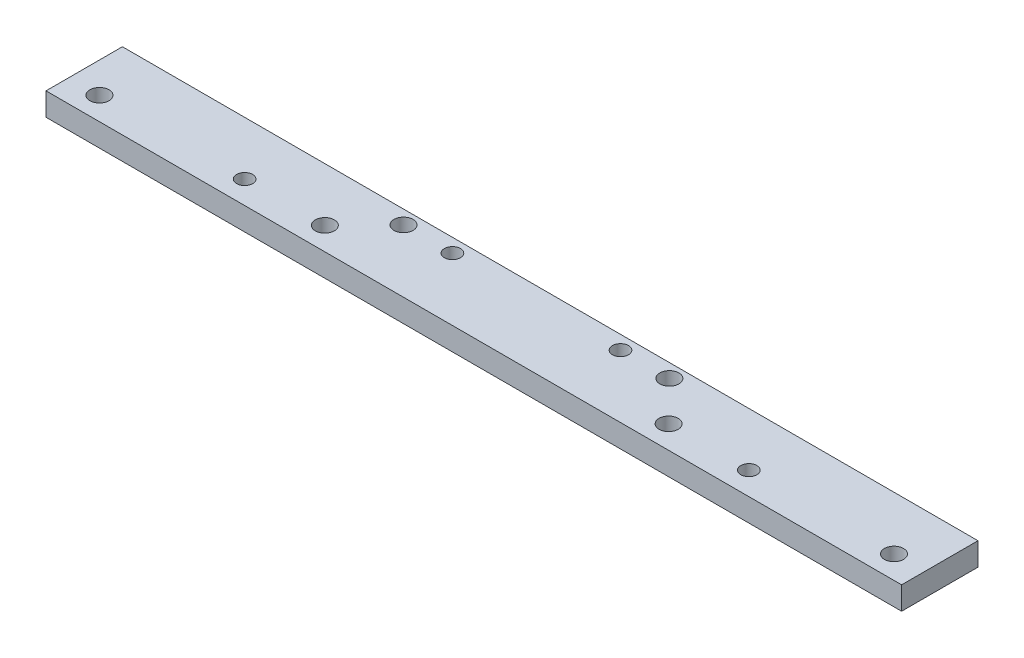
from build123d import *

# Parameters (mm, degrees)
ESQUISSE1_W             = 50
ESQUISSE1_H             = 15
EXTRUSION1_DEPTH        = 280
ENL_V_MAT_EXTRU_1_REACH = 283.514
ESQUISSE3_R             = 5.25
ESQUISSE3_R_2           = 6.25


with BuildPart() as part:
    # Esquisse1 → Extrusion1 (new, symmetric)
    with BuildSketch(Plane(origin=(0, 0, 0), x_dir=(0, 0, -1), z_dir=(1, 0, 0))):
        with Locations((0, 7.5)):
            Rectangle(ESQUISSE1_W, ESQUISSE1_H)
    extrude(amount=EXTRUSION1_DEPTH, both=True)

    # Esquisse3 → Enl_v. mat.-Extru.1 (cut, up to next)
    with BuildSketch(Plane(origin=(0, 15, 0), x_dir=(-1, 0, 0), z_dir=(0, 1, 0)), mode=Mode.PRIVATE) as enl_v_mat_extru_1_sk1:
        with Locations(Location((-55, -16, 0), (0, 0, 90))):
            Circle(ESQUISSE3_R)
    enl_v_mat_extru_1_tool1 = extrude(enl_v_mat_extru_1_sk1.sketch, amount=-ENL_V_MAT_EXTRU_1_REACH, mode=Mode.PRIVATE) & part.part
    # Esquisse3 → Enl_v. mat.-Extru.1 (cut, up to next)
    with BuildSketch(Plane(origin=(0, 15, 0), x_dir=(-1, 0, 0), z_dir=(0, 1, 0)), mode=Mode.PRIVATE) as enl_v_mat_extru_1_sk2:
        with Locations(Location((55, -16, 0), (0, 0, 90))):
            Circle(ESQUISSE3_R)
    enl_v_mat_extru_1_tool2 = extrude(enl_v_mat_extru_1_sk2.sketch, amount=-ENL_V_MAT_EXTRU_1_REACH, mode=Mode.PRIVATE) & part.part
    # Esquisse3 → Enl_v. mat.-Extru.1 (cut, up to next)
    with BuildSketch(Plane(origin=(0, 15, 0), x_dir=(-1, 0, 0), z_dir=(0, 1, 0)), mode=Mode.PRIVATE) as enl_v_mat_extru_1_sk3:
        with Locations(Location((-87, -16, 0), (0, 0, 90))):
            Circle(ESQUISSE3_R_2)
    enl_v_mat_extru_1_tool3 = extrude(enl_v_mat_extru_1_sk3.sketch, amount=-ENL_V_MAT_EXTRU_1_REACH, mode=Mode.PRIVATE) & part.part
    # Esquisse3 → Enl_v. mat.-Extru.1 (cut, up to next)
    with BuildSketch(Plane(origin=(0, 15, 0), x_dir=(-1, 0, 0), z_dir=(0, 1, 0)), mode=Mode.PRIVATE) as enl_v_mat_extru_1_sk4:
        with Locations(Location((87, -16, 0), (0, 0, 90))):
            Circle(ESQUISSE3_R_2)
    enl_v_mat_extru_1_tool4 = extrude(enl_v_mat_extru_1_sk4.sketch, amount=-ENL_V_MAT_EXTRU_1_REACH, mode=Mode.PRIVATE) & part.part
    # Esquisse3 → Enl_v. mat.-Extru.1 (cut, up to next)
    with BuildSketch(Plane(origin=(0, 15, 0), x_dir=(-1, 0, 0), z_dir=(0, 1, 0)), mode=Mode.PRIVATE) as enl_v_mat_extru_1_sk5:
        with Locations(Location((-112.5, 10, 0), (0, 0, 90))):
            Circle(ESQUISSE3_R_2)
    enl_v_mat_extru_1_tool5 = extrude(enl_v_mat_extru_1_sk5.sketch, amount=-ENL_V_MAT_EXTRU_1_REACH, mode=Mode.PRIVATE) & part.part
    # Esquisse3 → Enl_v. mat.-Extru.1 (cut, up to next)
    with BuildSketch(Plane(origin=(0, 15, 0), x_dir=(-1, 0, 0), z_dir=(0, 1, 0)), mode=Mode.PRIVATE) as enl_v_mat_extru_1_sk6:
        with Locations(Location((112.5, 10, 0), (0, 0, 90))):
            Circle(ESQUISSE3_R_2)
    enl_v_mat_extru_1_tool6 = extrude(enl_v_mat_extru_1_sk6.sketch, amount=-ENL_V_MAT_EXTRU_1_REACH, mode=Mode.PRIVATE) & part.part
    # Esquisse3 → Enl_v. mat.-Extru.1 (cut, up to next)
    with BuildSketch(Plane(origin=(0, 15, 0), x_dir=(-1, 0, 0), z_dir=(0, 1, 0)), mode=Mode.PRIVATE) as enl_v_mat_extru_1_sk7:
        with Locations(Location((-165, 10, 0), (0, 0, 90))):
            Circle(ESQUISSE3_R)
    enl_v_mat_extru_1_tool7 = extrude(enl_v_mat_extru_1_sk7.sketch, amount=-ENL_V_MAT_EXTRU_1_REACH, mode=Mode.PRIVATE) & part.part
    # Esquisse3 → Enl_v. mat.-Extru.1 (cut, up to next)
    with BuildSketch(Plane(origin=(0, 15, 0), x_dir=(-1, 0, 0), z_dir=(0, 1, 0)), mode=Mode.PRIVATE) as enl_v_mat_extru_1_sk8:
        with Locations(Location((165, 10, 0), (0, 0, 90))):
            Circle(ESQUISSE3_R)
    enl_v_mat_extru_1_tool8 = extrude(enl_v_mat_extru_1_sk8.sketch, amount=-ENL_V_MAT_EXTRU_1_REACH, mode=Mode.PRIVATE) & part.part
    # Esquisse3 → Enl_v. mat.-Extru.1 (cut, up to next)
    with BuildSketch(Plane(origin=(0, 15, 0), x_dir=(-1, 0, 0), z_dir=(0, 1, 0)), mode=Mode.PRIVATE) as enl_v_mat_extru_1_sk9:
        with Locations(Location((-260, 10, 0), (0, 0, 90))):
            Circle(ESQUISSE3_R_2)
    enl_v_mat_extru_1_tool9 = extrude(enl_v_mat_extru_1_sk9.sketch, amount=-ENL_V_MAT_EXTRU_1_REACH, mode=Mode.PRIVATE) & part.part
    # Esquisse3 → Enl_v. mat.-Extru.1 (cut, up to next)
    with BuildSketch(Plane(origin=(0, 15, 0), x_dir=(-1, 0, 0), z_dir=(0, 1, 0)), mode=Mode.PRIVATE) as enl_v_mat_extru_1_sk10:
        with Locations(Location((260, 10, 0), (0, 0, 90))):
            Circle(ESQUISSE3_R_2)
    enl_v_mat_extru_1_tool10 = extrude(enl_v_mat_extru_1_sk10.sketch, amount=-ENL_V_MAT_EXTRU_1_REACH, mode=Mode.PRIVATE) & part.part
    add(enl_v_mat_extru_1_tool1.solids().sort_by_distance((55, 15, -16))[0], mode=Mode.SUBTRACT)
    add(enl_v_mat_extru_1_tool2.solids().sort_by_distance((-55, 15, -16))[0], mode=Mode.SUBTRACT)
    add(enl_v_mat_extru_1_tool3.solids().sort_by_distance((87, 15, -16))[0], mode=Mode.SUBTRACT)
    add(enl_v_mat_extru_1_tool4.solids().sort_by_distance((-87, 15, -16))[0], mode=Mode.SUBTRACT)
    add(enl_v_mat_extru_1_tool5.solids().sort_by_distance((112.5, 15, 10))[0], mode=Mode.SUBTRACT)
    add(enl_v_mat_extru_1_tool6.solids().sort_by_distance((-112.5, 15, 10))[0], mode=Mode.SUBTRACT)
    add(enl_v_mat_extru_1_tool7.solids().sort_by_distance((165, 15, 10))[0], mode=Mode.SUBTRACT)
    add(enl_v_mat_extru_1_tool8.solids().sort_by_distance((-165, 15, 10))[0], mode=Mode.SUBTRACT)
    add(enl_v_mat_extru_1_tool9.solids().sort_by_distance((260, 15, 10))[0], mode=Mode.SUBTRACT)
    add(enl_v_mat_extru_1_tool10.solids().sort_by_distance((-260, 15, 10))[0], mode=Mode.SUBTRACT)


solid = part.part
